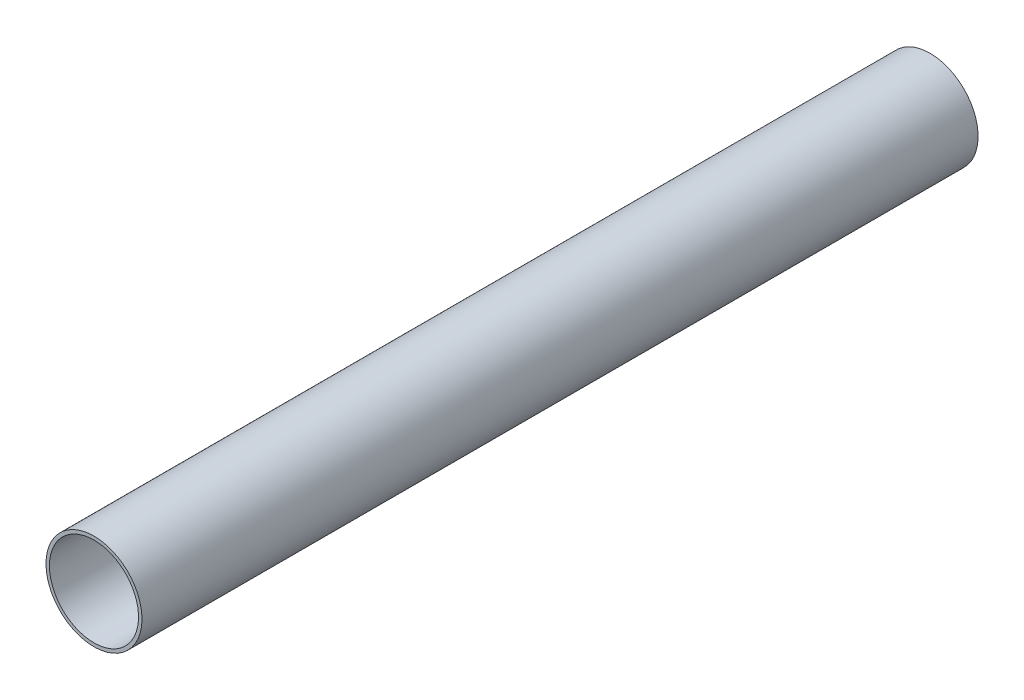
ISO-10303-21;
HEADER;
FILE_DESCRIPTION(('STEP AP214'),'2;1');
FILE_NAME('part.step','',(''),(''),'','','');
FILE_SCHEMA(('AUTOMOTIVE_DESIGN { 1 0 10303 214 1 1 1 1 }'));
ENDSEC;
DATA;
#1=APPLICATION_CONTEXT('core data for automotive mechanical design processes');
#2=APPLICATION_PROTOCOL_DEFINITION('international standard','automotive_design',2000,#1);
#3=PRODUCT_CONTEXT('',#1,'mechanical');
#4=PRODUCT('Part','Part','',(#3));
#5=PRODUCT_RELATED_PRODUCT_CATEGORY('part','',(#4));
#6=PRODUCT_DEFINITION_FORMATION('','',#4);
#7=PRODUCT_DEFINITION_CONTEXT('part definition',#1,'design');
#8=PRODUCT_DEFINITION('design','',#6,#7);
#9=PRODUCT_DEFINITION_SHAPE('','',#8);
#10=(LENGTH_UNIT() NAMED_UNIT(*) SI_UNIT(.MILLI.,.METRE.));
#11=(NAMED_UNIT(*) PLANE_ANGLE_UNIT() SI_UNIT($,.RADIAN.));
#12=(NAMED_UNIT(*) SI_UNIT($,.STERADIAN.) SOLID_ANGLE_UNIT());
#13=UNCERTAINTY_MEASURE_WITH_UNIT(LENGTH_MEASURE(1.E-05),#10,'distance_accuracy_value','');
#14=(GEOMETRIC_REPRESENTATION_CONTEXT(3) GLOBAL_UNCERTAINTY_ASSIGNED_CONTEXT((#13)) GLOBAL_UNIT_ASSIGNED_CONTEXT((#10,
#11,#12)) REPRESENTATION_CONTEXT('',''));
#15=CARTESIAN_POINT('',(0.,0.,0.));
#16=DIRECTION('',(0.,0.,1.));
#17=DIRECTION('',(1.,0.,0.));
#18=AXIS2_PLACEMENT_3D('',#15,#16,#17);
#19=CARTESIAN_POINT('',(0.,-2.12358363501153,244.));
#20=DIRECTION('',(0.,0.,1.));
#21=DIRECTION('',(1.,0.,0.));
#22=AXIS2_PLACEMENT_3D('',#19,#20,#21);
#23=PLANE('',#22);
#24=CARTESIAN_POINT('',(0.,-2.12358363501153,244.));
#25=DIRECTION('',(0.,0.,1.));
#26=DIRECTION('',(1.,0.,0.));
#27=AXIS2_PLACEMENT_3D('',#24,#25,#26);
#28=CIRCLE('',#27,14.);
#29=CARTESIAN_POINT('',(-14.,-2.12358363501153,244.));
#30=VERTEX_POINT('',#29);
#31=EDGE_CURVE('E11',#30,#30,#28,.T.);
#32=ORIENTED_EDGE('',*,*,#31,.T.);
#33=EDGE_LOOP('',(#32));
#34=FACE_BOUND('',#33,.T.);
#35=CARTESIAN_POINT('',(0.,-2.12358363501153,244.));
#36=DIRECTION('',(0.,0.,1.));
#37=DIRECTION('',(1.,0.,0.));
#38=AXIS2_PLACEMENT_3D('',#35,#36,#37);
#39=CIRCLE('',#38,13.);
#40=CARTESIAN_POINT('',(-13.,-2.12358363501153,244.));
#41=VERTEX_POINT('',#40);
#42=EDGE_CURVE('E52',#41,#41,#39,.T.);
#43=ORIENTED_EDGE('',*,*,#42,.F.);
#44=EDGE_LOOP('',(#43));
#45=FACE_BOUND('',#44,.T.);
#46=ADVANCED_FACE('F41',(#34,#45),#23,.T.);
#47=CARTESIAN_POINT('',(0.,-2.12358363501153,0.));
#48=DIRECTION('',(0.,0.,1.));
#49=DIRECTION('',(1.,0.,0.));
#50=AXIS2_PLACEMENT_3D('',#47,#48,#49);
#51=PLANE('',#50);
#52=CARTESIAN_POINT('',(0.,-2.12358363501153,0.));
#53=DIRECTION('',(0.,0.,1.));
#54=DIRECTION('',(1.,0.,0.));
#55=AXIS2_PLACEMENT_3D('',#52,#53,#54);
#56=CIRCLE('',#55,14.);
#57=CARTESIAN_POINT('',(-14.,-2.12358363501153,0.));
#58=VERTEX_POINT('',#57);
#59=EDGE_CURVE('E45',#58,#58,#56,.T.);
#60=ORIENTED_EDGE('',*,*,#59,.F.);
#61=EDGE_LOOP('',(#60));
#62=FACE_BOUND('',#61,.T.);
#63=CARTESIAN_POINT('',(0.,-2.12358363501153,0.));
#64=DIRECTION('',(0.,0.,1.));
#65=DIRECTION('',(1.,0.,0.));
#66=AXIS2_PLACEMENT_3D('',#63,#64,#65);
#67=CIRCLE('',#66,13.);
#68=CARTESIAN_POINT('',(-13.,-2.12358363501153,0.));
#69=VERTEX_POINT('',#68);
#70=EDGE_CURVE('E54',#69,#69,#67,.T.);
#71=ORIENTED_EDGE('',*,*,#70,.T.);
#72=EDGE_LOOP('',(#71));
#73=FACE_BOUND('',#72,.T.);
#74=ADVANCED_FACE('F64',(#62,#73),#51,.F.);
#75=CARTESIAN_POINT('',(0.,-2.12358363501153,244.));
#76=DIRECTION('',(0.,0.,-1.));
#77=DIRECTION('',(-1.,0.,0.));
#78=AXIS2_PLACEMENT_3D('',#75,#76,#77);
#79=CYLINDRICAL_SURFACE('',#78,14.);
#80=CARTESIAN_POINT('',(-14.,-2.12358363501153,244.));
#81=CARTESIAN_POINT('',(-14.,-2.12358363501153,241.458333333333));
#82=CARTESIAN_POINT('',(-14.,-2.12358363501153,238.916666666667));
#83=CARTESIAN_POINT('',(-14.,-2.12358363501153,233.833333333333));
#84=CARTESIAN_POINT('',(-14.,-2.12358363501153,231.291666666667));
#85=CARTESIAN_POINT('',(-14.,-2.12358363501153,226.208333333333));
#86=CARTESIAN_POINT('',(-14.,-2.12358363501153,223.666666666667));
#87=CARTESIAN_POINT('',(-14.,-2.12358363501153,218.583333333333));
#88=CARTESIAN_POINT('',(-14.,-2.12358363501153,216.041666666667));
#89=CARTESIAN_POINT('',(-14.,-2.12358363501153,210.958333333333));
#90=CARTESIAN_POINT('',(-14.,-2.12358363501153,208.416666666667));
#91=CARTESIAN_POINT('',(-14.,-2.12358363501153,203.333333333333));
#92=CARTESIAN_POINT('',(-14.,-2.12358363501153,200.791666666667));
#93=CARTESIAN_POINT('',(-14.,-2.12358363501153,195.708333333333));
#94=CARTESIAN_POINT('',(-14.,-2.12358363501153,193.166666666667));
#95=CARTESIAN_POINT('',(-14.,-2.12358363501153,188.083333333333));
#96=CARTESIAN_POINT('',(-14.,-2.12358363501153,185.541666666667));
#97=CARTESIAN_POINT('',(-14.,-2.12358363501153,180.458333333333));
#98=CARTESIAN_POINT('',(-14.,-2.12358363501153,177.916666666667));
#99=CARTESIAN_POINT('',(-14.,-2.12358363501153,172.833333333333));
#100=CARTESIAN_POINT('',(-14.,-2.12358363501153,170.291666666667));
#101=CARTESIAN_POINT('',(-14.,-2.12358363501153,165.208333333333));
#102=CARTESIAN_POINT('',(-14.,-2.12358363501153,162.666666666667));
#103=CARTESIAN_POINT('',(-14.,-2.12358363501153,157.583333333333));
#104=CARTESIAN_POINT('',(-14.,-2.12358363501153,155.041666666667));
#105=CARTESIAN_POINT('',(-14.,-2.12358363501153,149.958333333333));
#106=CARTESIAN_POINT('',(-14.,-2.12358363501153,147.416666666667));
#107=CARTESIAN_POINT('',(-14.,-2.12358363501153,142.333333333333));
#108=CARTESIAN_POINT('',(-14.,-2.12358363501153,139.791666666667));
#109=CARTESIAN_POINT('',(-14.,-2.12358363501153,134.708333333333));
#110=CARTESIAN_POINT('',(-14.,-2.12358363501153,132.166666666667));
#111=CARTESIAN_POINT('',(-14.,-2.12358363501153,127.083333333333));
#112=CARTESIAN_POINT('',(-14.,-2.12358363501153,124.541666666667));
#113=CARTESIAN_POINT('',(-14.,-2.12358363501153,119.458333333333));
#114=CARTESIAN_POINT('',(-14.,-2.12358363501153,116.916666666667));
#115=CARTESIAN_POINT('',(-14.,-2.12358363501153,111.833333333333));
#116=CARTESIAN_POINT('',(-14.,-2.12358363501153,109.291666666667));
#117=CARTESIAN_POINT('',(-14.,-2.12358363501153,104.208333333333));
#118=CARTESIAN_POINT('',(-14.,-2.12358363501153,101.666666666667));
#119=CARTESIAN_POINT('',(-14.,-2.12358363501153,96.5833333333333));
#120=CARTESIAN_POINT('',(-14.,-2.12358363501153,94.0416666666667));
#121=CARTESIAN_POINT('',(-14.,-2.12358363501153,88.9583333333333));
#122=CARTESIAN_POINT('',(-14.,-2.12358363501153,86.4166666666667));
#123=CARTESIAN_POINT('',(-14.,-2.12358363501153,81.3333333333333));
#124=CARTESIAN_POINT('',(-14.,-2.12358363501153,78.7916666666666));
#125=CARTESIAN_POINT('',(-14.,-2.12358363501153,73.7083333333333));
#126=CARTESIAN_POINT('',(-14.,-2.12358363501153,71.1666666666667));
#127=CARTESIAN_POINT('',(-14.,-2.12358363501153,66.0833333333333));
#128=CARTESIAN_POINT('',(-14.,-2.12358363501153,63.5416666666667));
#129=CARTESIAN_POINT('',(-14.,-2.12358363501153,58.4583333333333));
#130=CARTESIAN_POINT('',(-14.,-2.12358363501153,55.9166666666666));
#131=CARTESIAN_POINT('',(-14.,-2.12358363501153,50.8333333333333));
#132=CARTESIAN_POINT('',(-14.,-2.12358363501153,48.2916666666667));
#133=CARTESIAN_POINT('',(-14.,-2.12358363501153,43.2083333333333));
#134=CARTESIAN_POINT('',(-14.,-2.12358363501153,40.6666666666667));
#135=CARTESIAN_POINT('',(-14.,-2.12358363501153,35.5833333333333));
#136=CARTESIAN_POINT('',(-14.,-2.12358363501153,33.0416666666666));
#137=CARTESIAN_POINT('',(-14.,-2.12358363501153,27.9583333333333));
#138=CARTESIAN_POINT('',(-14.,-2.12358363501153,25.4166666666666));
#139=CARTESIAN_POINT('',(-14.,-2.12358363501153,20.3333333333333));
#140=CARTESIAN_POINT('',(-14.,-2.12358363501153,17.7916666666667));
#141=CARTESIAN_POINT('',(-14.,-2.12358363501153,12.7083333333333));
#142=CARTESIAN_POINT('',(-14.,-2.12358363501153,10.1666666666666));
#143=CARTESIAN_POINT('',(-14.,-2.12358363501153,5.0833333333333));
#144=CARTESIAN_POINT('',(-14.,-2.12358363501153,2.54166666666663));
#145=CARTESIAN_POINT('',(-14.,-2.12358363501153,0.));
#146=B_SPLINE_CURVE_WITH_KNOTS('',3,(#80,#81,#82,#83,#84,#85,#86,#87,#88,#89,#90,#91,#92,#93,
#94,#95,#96,#97,#98,#99,#100,#101,#102,#103,#104,#105,#106,#107,#108,#109,#110,#111,#112,#113,
#114,#115,#116,#117,#118,#119,#120,#121,#122,#123,#124,#125,#126,#127,#128,#129,#130,#131,#132,
#133,#134,#135,#136,#137,#138,#139,#140,#141,#142,#143,#144,#145),.UNSPECIFIED.,.F.,.F.,(4,2,2,
2,2,2,2,2,2,2,2,2,2,2,2,2,2,2,2,2,2,2,2,2,2,2,2,2,2,2,2,2,4),(0.,7.62500000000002,15.25,22.875,
30.5,38.125,45.75,53.375,61.,68.625,76.25,83.875,91.5,99.125,106.75,114.375,122.,129.625,137.25,
144.875,152.5,160.125,167.75,175.375,183.,190.625,198.25,205.875,213.5,221.125,228.75,236.375,
244.),.UNSPECIFIED.);
#147=EDGE_CURVE('BSEAM43',#30,#58,#146,.T.);
#148=ORIENTED_EDGE('',*,*,#31,.F.);
#149=ORIENTED_EDGE('',*,*,#59,.T.);
#150=ORIENTED_EDGE('',*,*,#147,.T.);
#151=ORIENTED_EDGE('',*,*,#147,.F.);
#152=EDGE_LOOP('',(#148,#150,#149,#151));
#153=FACE_BOUND('',#152,.T.);
#154=ADVANCED_FACE('F43',(#153),#79,.T.);
#155=CARTESIAN_POINT('',(0.,-2.12358363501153,244.));
#156=DIRECTION('',(0.,0.,-1.));
#157=DIRECTION('',(-1.,0.,0.));
#158=AXIS2_PLACEMENT_3D('',#155,#156,#157);
#159=CYLINDRICAL_SURFACE('',#158,13.);
#160=CARTESIAN_POINT('',(-13.,-2.12358363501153,244.));
#161=CARTESIAN_POINT('',(-13.,-2.12358363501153,241.458333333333));
#162=CARTESIAN_POINT('',(-13.,-2.12358363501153,238.916666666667));
#163=CARTESIAN_POINT('',(-13.,-2.12358363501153,233.833333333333));
#164=CARTESIAN_POINT('',(-13.,-2.12358363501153,231.291666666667));
#165=CARTESIAN_POINT('',(-13.,-2.12358363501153,226.208333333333));
#166=CARTESIAN_POINT('',(-13.,-2.12358363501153,223.666666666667));
#167=CARTESIAN_POINT('',(-13.,-2.12358363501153,218.583333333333));
#168=CARTESIAN_POINT('',(-13.,-2.12358363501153,216.041666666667));
#169=CARTESIAN_POINT('',(-13.,-2.12358363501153,210.958333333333));
#170=CARTESIAN_POINT('',(-13.,-2.12358363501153,208.416666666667));
#171=CARTESIAN_POINT('',(-13.,-2.12358363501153,203.333333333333));
#172=CARTESIAN_POINT('',(-13.,-2.12358363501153,200.791666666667));
#173=CARTESIAN_POINT('',(-13.,-2.12358363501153,195.708333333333));
#174=CARTESIAN_POINT('',(-13.,-2.12358363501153,193.166666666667));
#175=CARTESIAN_POINT('',(-13.,-2.12358363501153,188.083333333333));
#176=CARTESIAN_POINT('',(-13.,-2.12358363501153,185.541666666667));
#177=CARTESIAN_POINT('',(-13.,-2.12358363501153,180.458333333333));
#178=CARTESIAN_POINT('',(-13.,-2.12358363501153,177.916666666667));
#179=CARTESIAN_POINT('',(-13.,-2.12358363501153,172.833333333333));
#180=CARTESIAN_POINT('',(-13.,-2.12358363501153,170.291666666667));
#181=CARTESIAN_POINT('',(-13.,-2.12358363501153,165.208333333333));
#182=CARTESIAN_POINT('',(-13.,-2.12358363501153,162.666666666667));
#183=CARTESIAN_POINT('',(-13.,-2.12358363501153,157.583333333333));
#184=CARTESIAN_POINT('',(-13.,-2.12358363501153,155.041666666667));
#185=CARTESIAN_POINT('',(-13.,-2.12358363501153,149.958333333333));
#186=CARTESIAN_POINT('',(-13.,-2.12358363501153,147.416666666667));
#187=CARTESIAN_POINT('',(-13.,-2.12358363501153,142.333333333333));
#188=CARTESIAN_POINT('',(-13.,-2.12358363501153,139.791666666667));
#189=CARTESIAN_POINT('',(-13.,-2.12358363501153,134.708333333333));
#190=CARTESIAN_POINT('',(-13.,-2.12358363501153,132.166666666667));
#191=CARTESIAN_POINT('',(-13.,-2.12358363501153,127.083333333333));
#192=CARTESIAN_POINT('',(-13.,-2.12358363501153,124.541666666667));
#193=CARTESIAN_POINT('',(-13.,-2.12358363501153,119.458333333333));
#194=CARTESIAN_POINT('',(-13.,-2.12358363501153,116.916666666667));
#195=CARTESIAN_POINT('',(-13.,-2.12358363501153,111.833333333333));
#196=CARTESIAN_POINT('',(-13.,-2.12358363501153,109.291666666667));
#197=CARTESIAN_POINT('',(-13.,-2.12358363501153,104.208333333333));
#198=CARTESIAN_POINT('',(-13.,-2.12358363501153,101.666666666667));
#199=CARTESIAN_POINT('',(-13.,-2.12358363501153,96.5833333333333));
#200=CARTESIAN_POINT('',(-13.,-2.12358363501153,94.0416666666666));
#201=CARTESIAN_POINT('',(-13.,-2.12358363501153,88.9583333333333));
#202=CARTESIAN_POINT('',(-13.,-2.12358363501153,86.4166666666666));
#203=CARTESIAN_POINT('',(-13.,-2.12358363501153,81.3333333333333));
#204=CARTESIAN_POINT('',(-13.,-2.12358363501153,78.7916666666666));
#205=CARTESIAN_POINT('',(-13.,-2.12358363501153,73.7083333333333));
#206=CARTESIAN_POINT('',(-13.,-2.12358363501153,71.1666666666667));
#207=CARTESIAN_POINT('',(-13.,-2.12358363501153,66.0833333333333));
#208=CARTESIAN_POINT('',(-13.,-2.12358363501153,63.5416666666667));
#209=CARTESIAN_POINT('',(-13.,-2.12358363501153,58.4583333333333));
#210=CARTESIAN_POINT('',(-13.,-2.12358363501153,55.9166666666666));
#211=CARTESIAN_POINT('',(-13.,-2.12358363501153,50.8333333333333));
#212=CARTESIAN_POINT('',(-13.,-2.12358363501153,48.2916666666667));
#213=CARTESIAN_POINT('',(-13.,-2.12358363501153,43.2083333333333));
#214=CARTESIAN_POINT('',(-13.,-2.12358363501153,40.6666666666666));
#215=CARTESIAN_POINT('',(-13.,-2.12358363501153,35.5833333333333));
#216=CARTESIAN_POINT('',(-13.,-2.12358363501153,33.0416666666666));
#217=CARTESIAN_POINT('',(-13.,-2.12358363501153,27.9583333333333));
#218=CARTESIAN_POINT('',(-13.,-2.12358363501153,25.4166666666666));
#219=CARTESIAN_POINT('',(-13.,-2.12358363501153,20.3333333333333));
#220=CARTESIAN_POINT('',(-13.,-2.12358363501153,17.7916666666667));
#221=CARTESIAN_POINT('',(-13.,-2.12358363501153,12.7083333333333));
#222=CARTESIAN_POINT('',(-13.,-2.12358363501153,10.1666666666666));
#223=CARTESIAN_POINT('',(-13.,-2.12358363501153,5.0833333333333));
#224=CARTESIAN_POINT('',(-13.,-2.12358363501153,2.54166666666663));
#225=CARTESIAN_POINT('',(-13.,-2.12358363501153,0.));
#226=B_SPLINE_CURVE_WITH_KNOTS('',3,(#160,#161,#162,#163,#164,#165,#166,#167,#168,#169,#170,
#171,#172,#173,#174,#175,#176,#177,#178,#179,#180,#181,#182,#183,#184,#185,#186,#187,#188,#189,
#190,#191,#192,#193,#194,#195,#196,#197,#198,#199,#200,#201,#202,#203,#204,#205,#206,#207,#208,
#209,#210,#211,#212,#213,#214,#215,#216,#217,#218,#219,#220,#221,#222,#223,#224,#225),
.UNSPECIFIED.,.F.,.F.,(4,2,2,2,2,2,2,2,2,2,2,2,2,2,2,2,2,2,2,2,2,2,2,2,2,2,2,2,2,2,2,2,4),(0.,
7.62499999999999,15.25,22.875,30.5,38.125,45.75,53.375,61.,68.625,76.25,83.875,91.5,99.125,
106.75,114.375,122.,129.625,137.25,144.875,152.5,160.125,167.75,175.375,183.,190.625,198.25,
205.875,213.5,221.125,228.75,236.375,244.),.UNSPECIFIED.);
#227=EDGE_CURVE('BSEAM60',#41,#69,#226,.T.);
#228=ORIENTED_EDGE('',*,*,#42,.T.);
#229=ORIENTED_EDGE('',*,*,#70,.F.);
#230=ORIENTED_EDGE('',*,*,#227,.T.);
#231=ORIENTED_EDGE('',*,*,#227,.F.);
#232=EDGE_LOOP('',(#228,#230,#229,#231));
#233=FACE_BOUND('',#232,.T.);
#234=ADVANCED_FACE('F60',(#233),#159,.F.);
#235=CLOSED_SHELL('',(#46,#74,#154,#234));
#236=MANIFOLD_SOLID_BREP('B2',#235);
#237=ADVANCED_BREP_SHAPE_REPRESENTATION('',(#18,#236),#14);
#238=SHAPE_DEFINITION_REPRESENTATION(#9,#237);
ENDSEC;
END-ISO-10303-21;
